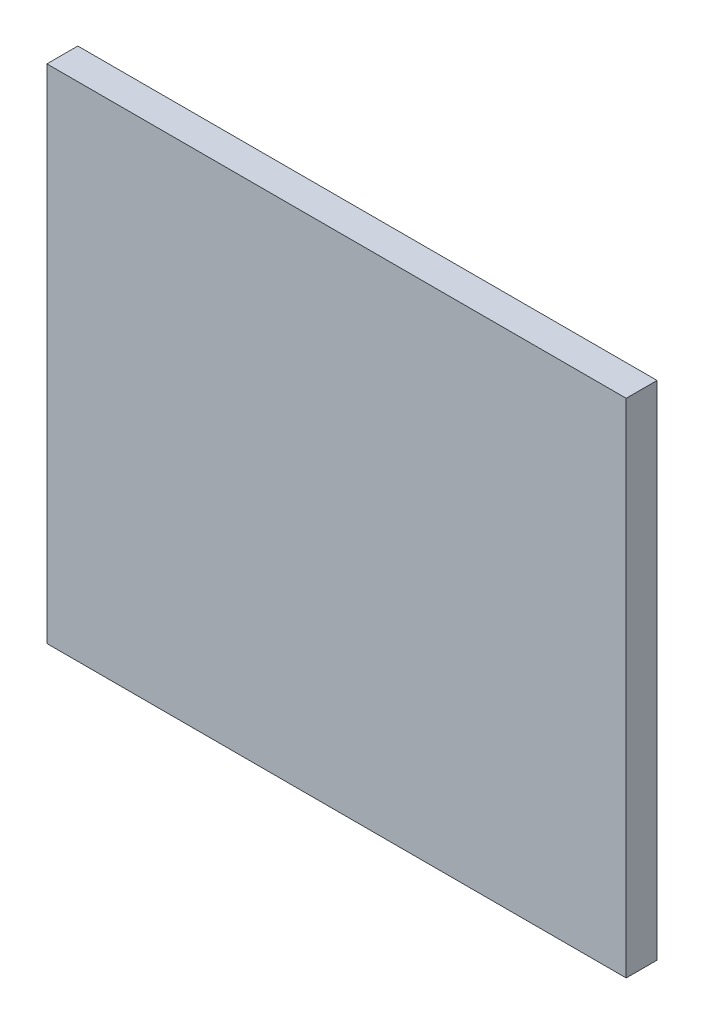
ISO-10303-21;
HEADER;
FILE_DESCRIPTION(('STEP AP214'),'2;1');
FILE_NAME('part.step','',(''),(''),'','','');
FILE_SCHEMA(('AUTOMOTIVE_DESIGN { 1 0 10303 214 1 1 1 1 }'));
ENDSEC;
DATA;
#1=APPLICATION_CONTEXT('core data for automotive mechanical design processes');
#2=APPLICATION_PROTOCOL_DEFINITION('international standard','automotive_design',2000,#1);
#3=PRODUCT_CONTEXT('',#1,'mechanical');
#4=PRODUCT('Part','Part','',(#3));
#5=PRODUCT_RELATED_PRODUCT_CATEGORY('part','',(#4));
#6=PRODUCT_DEFINITION_FORMATION('','',#4);
#7=PRODUCT_DEFINITION_CONTEXT('part definition',#1,'design');
#8=PRODUCT_DEFINITION('design','',#6,#7);
#9=PRODUCT_DEFINITION_SHAPE('','',#8);
#10=(LENGTH_UNIT() NAMED_UNIT(*) SI_UNIT(.MILLI.,.METRE.));
#11=(NAMED_UNIT(*) PLANE_ANGLE_UNIT() SI_UNIT($,.RADIAN.));
#12=(NAMED_UNIT(*) SI_UNIT($,.STERADIAN.) SOLID_ANGLE_UNIT());
#13=UNCERTAINTY_MEASURE_WITH_UNIT(LENGTH_MEASURE(1.E-05),#10,'distance_accuracy_value','');
#14=(GEOMETRIC_REPRESENTATION_CONTEXT(3) GLOBAL_UNCERTAINTY_ASSIGNED_CONTEXT((#13)) GLOBAL_UNIT_ASSIGNED_CONTEXT((#10,
#11,#12)) REPRESENTATION_CONTEXT('',''));
#15=CARTESIAN_POINT('',(0.,0.,0.));
#16=DIRECTION('',(0.,0.,1.));
#17=DIRECTION('',(1.,0.,0.));
#18=AXIS2_PLACEMENT_3D('',#15,#16,#17);
#19=CARTESIAN_POINT('',(0.,0.,8.));
#20=DIRECTION('',(1.,0.,0.));
#21=DIRECTION('',(0.,0.,-1.));
#22=AXIS2_PLACEMENT_3D('',#19,#20,#21);
#23=PLANE('',#22);
#24=DIRECTION('',(0.,-1.,0.));
#25=VECTOR('',#24,1.);
#26=CARTESIAN_POINT('',(0.,0.,0.));
#27=LINE('',#26,#25);
#28=CARTESIAN_POINT('',(0.,130.,0.));
#29=VERTEX_POINT('',#28);
#30=CARTESIAN_POINT('',(0.,0.,0.));
#31=VERTEX_POINT('',#30);
#32=EDGE_CURVE('E85',#29,#31,#27,.T.);
#33=ORIENTED_EDGE('',*,*,#32,.T.);
#34=DIRECTION('',(0.,0.,-1.));
#35=VECTOR('',#34,1.);
#36=CARTESIAN_POINT('',(0.,0.,8.));
#37=LINE('',#36,#35);
#38=CARTESIAN_POINT('',(0.,0.,8.));
#39=VERTEX_POINT('',#38);
#40=EDGE_CURVE('E11',#39,#31,#37,.T.);
#41=ORIENTED_EDGE('',*,*,#40,.F.);
#42=DIRECTION('',(0.,-1.,0.));
#43=VECTOR('',#42,1.);
#44=CARTESIAN_POINT('',(0.,0.,8.));
#45=LINE('',#44,#43);
#46=CARTESIAN_POINT('',(0.,130.,8.));
#47=VERTEX_POINT('',#46);
#48=EDGE_CURVE('E103',#47,#39,#45,.T.);
#49=ORIENTED_EDGE('',*,*,#48,.F.);
#50=DIRECTION('',(0.,0.,-1.));
#51=VECTOR('',#50,1.);
#52=CARTESIAN_POINT('',(0.,130.,8.));
#53=LINE('',#52,#51);
#54=EDGE_CURVE('E97',#47,#29,#53,.T.);
#55=ORIENTED_EDGE('',*,*,#54,.T.);
#56=EDGE_LOOP('',(#33,#41,#49,#55));
#57=FACE_BOUND('',#56,.T.);
#58=ADVANCED_FACE('F41',(#57),#23,.F.);
#59=CARTESIAN_POINT('',(0.,0.,8.));
#60=DIRECTION('',(0.,1.,0.));
#61=DIRECTION('',(0.,0.,1.));
#62=AXIS2_PLACEMENT_3D('',#59,#60,#61);
#63=PLANE('',#62);
#64=DIRECTION('',(1.,0.,0.));
#65=VECTOR('',#64,1.);
#66=CARTESIAN_POINT('',(0.,0.,0.));
#67=LINE('',#66,#65);
#68=CARTESIAN_POINT('',(150.,0.,0.));
#69=VERTEX_POINT('',#68);
#70=EDGE_CURVE('E81',#31,#69,#67,.T.);
#71=ORIENTED_EDGE('',*,*,#70,.T.);
#72=DIRECTION('',(0.,0.,-1.));
#73=VECTOR('',#72,1.);
#74=CARTESIAN_POINT('',(150.,0.,8.));
#75=LINE('',#74,#73);
#76=CARTESIAN_POINT('',(150.,0.,8.));
#77=VERTEX_POINT('',#76);
#78=EDGE_CURVE('E48',#77,#69,#75,.T.);
#79=ORIENTED_EDGE('',*,*,#78,.F.);
#80=DIRECTION('',(1.,0.,0.));
#81=VECTOR('',#80,1.);
#82=CARTESIAN_POINT('',(0.,0.,8.));
#83=LINE('',#82,#81);
#84=EDGE_CURVE('E93',#39,#77,#83,.T.);
#85=ORIENTED_EDGE('',*,*,#84,.F.);
#86=ORIENTED_EDGE('',*,*,#40,.T.);
#87=EDGE_LOOP('',(#71,#79,#85,#86));
#88=FACE_BOUND('',#87,.T.);
#89=ADVANCED_FACE('F92',(#88),#63,.F.);
#90=CARTESIAN_POINT('',(150.,0.,8.));
#91=DIRECTION('',(-1.,0.,0.));
#92=DIRECTION('',(0.,0.,1.));
#93=AXIS2_PLACEMENT_3D('',#90,#91,#92);
#94=PLANE('',#93);
#95=DIRECTION('',(0.,1.,0.));
#96=VECTOR('',#95,1.);
#97=CARTESIAN_POINT('',(150.,0.,0.));
#98=LINE('',#97,#96);
#99=CARTESIAN_POINT('',(150.,130.,0.));
#100=VERTEX_POINT('',#99);
#101=EDGE_CURVE('E86',#69,#100,#98,.T.);
#102=ORIENTED_EDGE('',*,*,#101,.T.);
#103=DIRECTION('',(0.,0.,-1.));
#104=VECTOR('',#103,1.);
#105=CARTESIAN_POINT('',(150.,130.,8.));
#106=LINE('',#105,#104);
#107=CARTESIAN_POINT('',(150.,130.,8.));
#108=VERTEX_POINT('',#107);
#109=EDGE_CURVE('E109',#108,#100,#106,.T.);
#110=ORIENTED_EDGE('',*,*,#109,.F.);
#111=DIRECTION('',(0.,1.,0.));
#112=VECTOR('',#111,1.);
#113=CARTESIAN_POINT('',(150.,0.,8.));
#114=LINE('',#113,#112);
#115=EDGE_CURVE('E60',#77,#108,#114,.T.);
#116=ORIENTED_EDGE('',*,*,#115,.F.);
#117=ORIENTED_EDGE('',*,*,#78,.T.);
#118=EDGE_LOOP('',(#102,#110,#116,#117));
#119=FACE_BOUND('',#118,.T.);
#120=ADVANCED_FACE('F112',(#119),#94,.F.);
#121=CARTESIAN_POINT('',(0.,130.,8.));
#122=DIRECTION('',(0.,-1.,0.));
#123=DIRECTION('',(0.,0.,-1.));
#124=AXIS2_PLACEMENT_3D('',#121,#122,#123);
#125=PLANE('',#124);
#126=DIRECTION('',(-1.,0.,0.));
#127=VECTOR('',#126,1.);
#128=CARTESIAN_POINT('',(0.,130.,0.));
#129=LINE('',#128,#127);
#130=EDGE_CURVE('E101',#100,#29,#129,.T.);
#131=ORIENTED_EDGE('',*,*,#130,.T.);
#132=ORIENTED_EDGE('',*,*,#54,.F.);
#133=DIRECTION('',(-1.,0.,0.));
#134=VECTOR('',#133,1.);
#135=CARTESIAN_POINT('',(0.,130.,8.));
#136=LINE('',#135,#134);
#137=EDGE_CURVE('E55',#108,#47,#136,.T.);
#138=ORIENTED_EDGE('',*,*,#137,.F.);
#139=ORIENTED_EDGE('',*,*,#109,.T.);
#140=EDGE_LOOP('',(#131,#132,#138,#139));
#141=FACE_BOUND('',#140,.T.);
#142=ADVANCED_FACE('F114',(#141),#125,.F.);
#143=CARTESIAN_POINT('',(0.,130.,8.));
#144=DIRECTION('',(0.,0.,-1.));
#145=DIRECTION('',(-1.,0.,0.));
#146=AXIS2_PLACEMENT_3D('',#143,#144,#145);
#147=PLANE('',#146);
#148=ORIENTED_EDGE('',*,*,#48,.T.);
#149=ORIENTED_EDGE('',*,*,#84,.T.);
#150=ORIENTED_EDGE('',*,*,#115,.T.);
#151=ORIENTED_EDGE('',*,*,#137,.T.);
#152=EDGE_LOOP('',(#148,#149,#150,#151));
#153=FACE_BOUND('',#152,.T.);
#154=ADVANCED_FACE('F115',(#153),#147,.F.);
#155=CARTESIAN_POINT('',(0.,130.,0.));
#156=DIRECTION('',(0.,0.,-1.));
#157=DIRECTION('',(-1.,0.,0.));
#158=AXIS2_PLACEMENT_3D('',#155,#156,#157);
#159=PLANE('',#158);
#160=ORIENTED_EDGE('',*,*,#32,.F.);
#161=ORIENTED_EDGE('',*,*,#130,.F.);
#162=ORIENTED_EDGE('',*,*,#101,.F.);
#163=ORIENTED_EDGE('',*,*,#70,.F.);
#164=EDGE_LOOP('',(#160,#161,#162,#163));
#165=FACE_BOUND('',#164,.T.);
#166=ADVANCED_FACE('F82',(#165),#159,.T.);
#167=CLOSED_SHELL('',(#58,#89,#120,#142,#154,#166));
#168=MANIFOLD_SOLID_BREP('B2',#167);
#169=ADVANCED_BREP_SHAPE_REPRESENTATION('',(#18,#168),#14);
#170=SHAPE_DEFINITION_REPRESENTATION(#9,#169);
ENDSEC;
END-ISO-10303-21;
